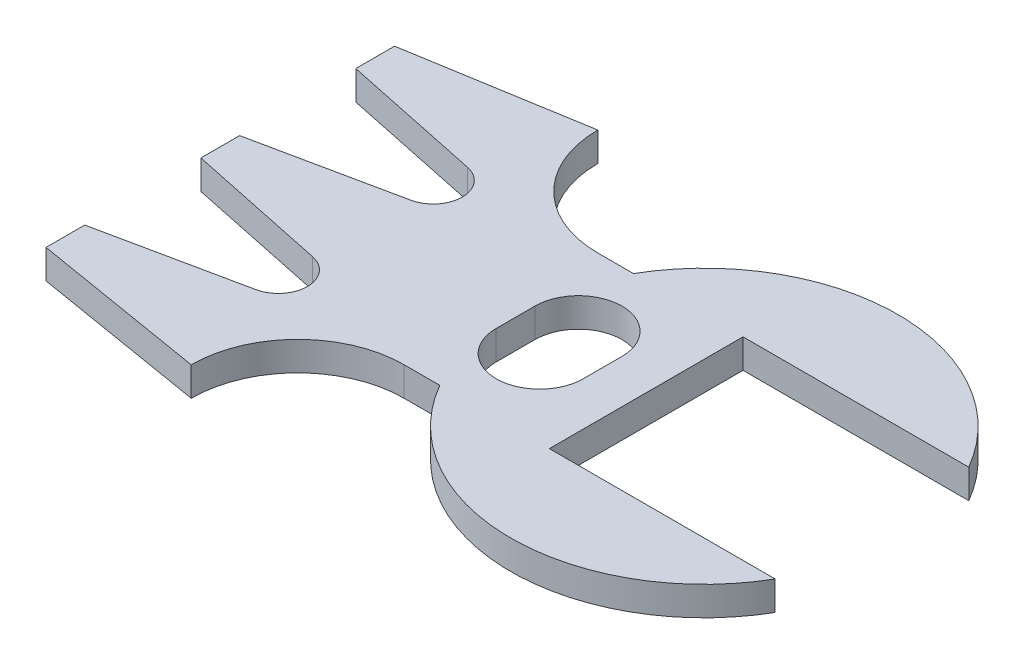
from build123d import *

# Parameters (mm, degrees)
EXTRUDE1_DEPTH = 3


with BuildPart() as part:
    # Sketch1 → Extrude1 (new body)
    with BuildSketch(Plane(origin=(0, 0, 0), x_dir=(1, 0, 0), z_dir=(0, 1, 0))):
        with BuildLine():
            Line((0, 3), (0, 7))
            Line((0, 7), (14.615505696, 10.063820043))
            ThreePointArc((14.615505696, 10.063820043), (17, 13), (14.615505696, 15.936179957))
            Line((14.615505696, 15.936179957), (0, 19))
            Line((0, 19), (0, 23))
            Line((0, 23), (14.615505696, 26.063820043))
            ThreePointArc((14.615505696, 26.063820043), (17, 29), (14.615505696, 31.936179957))
            Line((14.615505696, 31.936179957), (0, 35))
            Line((0, 35), (0, 39))
            Line((0, 39), (18, 42))
            ThreePointArc((18, 42), (21.221825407, 34.221825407), (29, 31))
            Line((29, 31), (32.679491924, 31))
            ThreePointArc((32.679491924, 31), (50, 41), (67.320508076, 31))
            Line((67.320508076, 31), (44, 31))
            Line((44, 31), (44, 11))
            Line((44, 11), (67.320508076, 11))
            ThreePointArc((67.320508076, 11), (50, 1), (32.679491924, 11))
            Line((32.679491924, 11), (29, 11))
            ThreePointArc((29, 11), (21.221825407, 7.778174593), (18, 0))
            Line((18, 0), (0, 3))
        make_face()
        with BuildLine():
            Line((39.5, 23), (39.5, 19))
            ThreePointArc((39.5, 19), (35, 14.5), (30.5, 19))
            Line((30.5, 19), (30.5, 23))
            ThreePointArc((30.5, 23), (35, 27.5), (39.5, 23))
        make_face(mode=Mode.SUBTRACT)
    extrude(amount=EXTRUDE1_DEPTH)


solid = part.part
